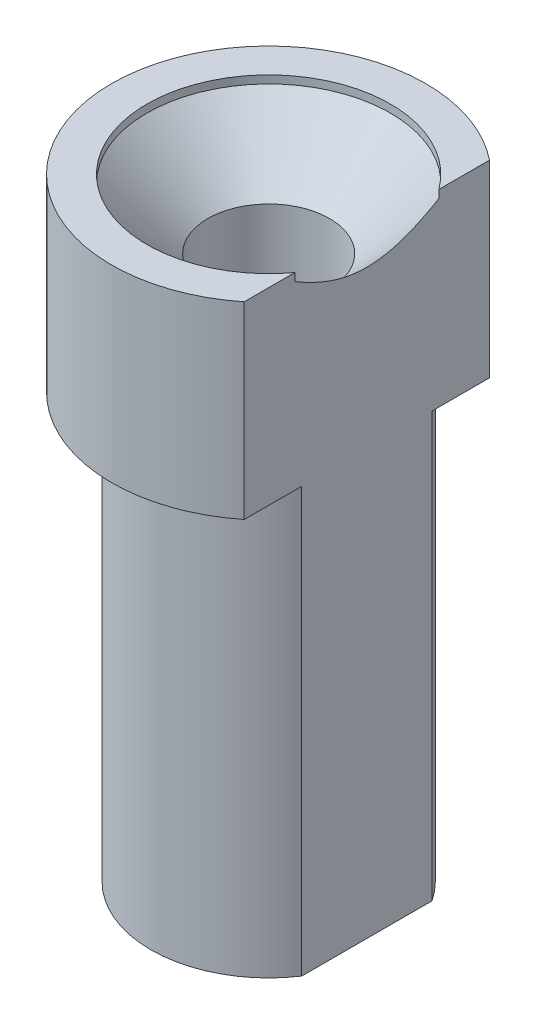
from build123d import *

# Parameters (mm, degrees)
SKETCH2_W          = 3
SKETCH2_H          = 12.897930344
CUT_EXTRUDE2_DEPTH = 17.59397481
SKETCH3_W          = 3
SKETCH3_H          = 10
CUT_EXTRUDE3_DEPTH = 5.1


with BuildPart() as part:
    # Sketch1 → Revolve1 (revolve)
    with BuildSketch(Plane(origin=(0, 0, 0), x_dir=(0, 0, -1), z_dir=(1, 0, 0)), mode=Mode.PRIVATE) as revolve1_sk:
        Polygon((1.55, 0), (3, 0), (3, 10.8), (4, 10.8), (4, 15.6), (3.1, 15.6), (3.1, 15.4), (1.55, 13.85), align=None)
    revolve(revolve1_sk.sketch.rotate(Axis((0, 0, 0), (0, -1, 0)), 180), axis=Axis((0, 0, 0), (0, -1, 0)))

    # Sketch2 → Cut-Extrude2 (cut, through all)
    with BuildSketch(Plane(origin=(0, 0, 0), x_dir=(1, 0, 0), z_dir=(0, 1, 0))):
        with Locations((4, 0)):
            Rectangle(SKETCH2_W, SKETCH2_H)
    extrude(amount=CUT_EXTRUDE2_DEPTH, mode=Mode.SUBTRACT)

    # Sketch3 → Cut-Extrude3 (cut)
    with BuildSketch(Plane(origin=(0, 0, 0), x_dir=(1, 0, 0), z_dir=(0, 1, 0))):
        with Locations((-4, 0)):
            Rectangle(SKETCH3_W, SKETCH3_H)
    extrude(amount=CUT_EXTRUDE3_DEPTH, mode=Mode.SUBTRACT)


solid = part.part
